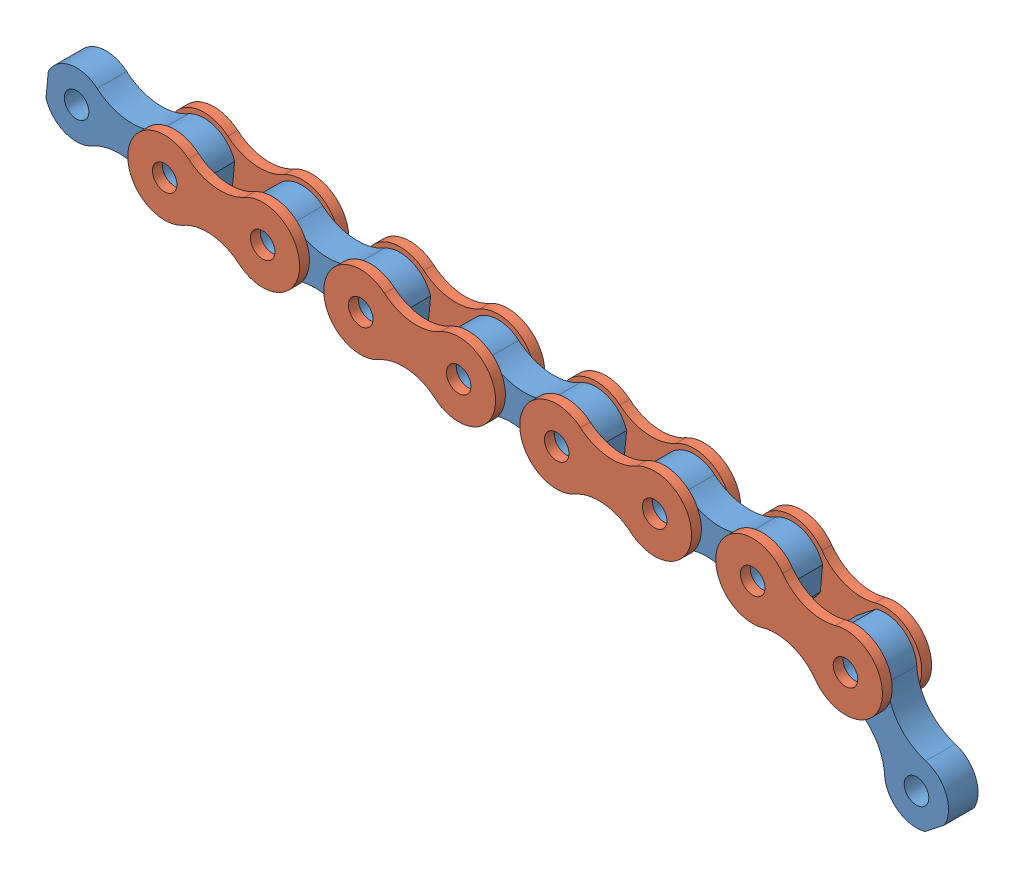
SolidWorks assembly KETTE AUF BAHN.SLDASM, configuration Standard (file format 3400). Lengths in mm.
Overall size (265.73 114.46 10).
17 component instances, 2 part files, 15 mates.
Components (placement in the parent):
- TEILGLIED-1: TEILGLIED.SLDASM [Standard-_flexible1] at (-21.8981 56.9083 0) x (-0.995612 0.093582 0) z (0 0 1) size (54 32.39 10) (flexible)
  - GLIED-1: GLIED.SLDPRT [Standard] at origin size (33 32.39 6)
  - Lasche-1: Lasche.SLDPRT [Standard] at (-20 0 -5) size (35 15 2)
  - Lasche-2: Lasche.SLDPRT [Standard] at (-20 0 3) size (35 15 2)
- TEILGLIED-2: TEILGLIED.SLDASM [Standard-_flexible2] at (17.9264 53.165 0) x (-0.995612 0.093582 0) z (0 0 1) size (53.76 33.04 10) (flexible)
  - GLIED-1: GLIED.SLDPRT [Standard] at origin size (33 32.39 6)
  - Lasche-1: Lasche.SLDPRT [Standard] at (-20 0 -5) size (35 15 2)
  - Lasche-2: Lasche.SLDPRT [Standard] at (-20 0 3) size (35 15 2)
- TEILGLIED-3: TEILGLIED.SLDASM [Standard-_flexible3] at (57.7508 49.4217 0) x (-0.995612 0.093582 0) z (0 0 1) size (53.76 33.04 10) (flexible)
  - GLIED-1: GLIED.SLDPRT [Standard] at origin size (33 32.39 6)
  - Lasche-1: Lasche.SLDPRT [Standard] at (-20 0 -5) size (35 15 2)
  - Lasche-2: Lasche.SLDPRT [Standard] at (-20 0 3) size (35 15 2)
- TEILGLIED-4: TEILGLIED.SLDASM [Standard-_flexible4] at (97.5753 45.6784 0) x (-0.995612 0.093582 0) z (0 0 1) size (55 32.39 10) (flexible)
  - GLIED-1: GLIED.SLDPRT [Standard] at origin size (33 32.39 6)
  - Lasche-1: Lasche.SLDPRT [Standard] at (-19.4019 4.8545 -5) x (0.970095 -0.242726 0) z (0 0 1) size (35 15 2)
  - Lasche-2: Lasche.SLDPRT [Standard] at (-19.4019 4.8545 3) x (0.970095 -0.242726 0) z (0 0 1) size (35 15 2)
- GLIED-1: GLIED.SLDPRT [Standard] at (116.4377 39.0295 0) x (0.621652 -0.783293 0) z (0 0 1) size (33 32.39 6)
Mates (geometry in assembly coordinates):
- Parallel1: parallel: unknown of TEILGLIED-1/GLIED-1
- Konzentrisch2: concentric: cylinder of TEILGLIED-1/Lasche-2; cylinder of TEILGLIED-2/GLIED-1
- Konzentrisch3: concentric: cylinder of TEILGLIED-2/Lasche-2; cylinder of TEILGLIED-3/GLIED-1
- Konzentrisch4: concentric: cylinder of TEILGLIED-3/Lasche-2; cylinder of TEILGLIED-4/GLIED-1
- Deckungsgleich7: coincident: point of TEILGLIED-1/GLIED-1
- Deckungsgleich8: coincident: unknown of TEILGLIED-1/GLIED-1
- Deckungsgleich9: coincident: unknown of TEILGLIED-2/GLIED-1
- Deckungsgleich10: coincident: unknown of TEILGLIED-2/GLIED-1
- Deckungsgleich11: coincident: unknown of TEILGLIED-3/GLIED-1
- Deckungsgleich12: coincident: unknown of TEILGLIED-3/GLIED-1
- Deckungsgleich13: coincident: unknown of TEILGLIED-4/GLIED-1
- Deckungsgleich16: coincident: unknown of TEILGLIED-4/GLIED-1
- Deckungsgleich17: coincident: unknown of GLIED-1
- Deckungsgleich18: coincident: unknown of GLIED-1
- Konzentrisch5: concentric: unknown of TEILGLIED-4/Lasche-2; unknown of GLIED-1
